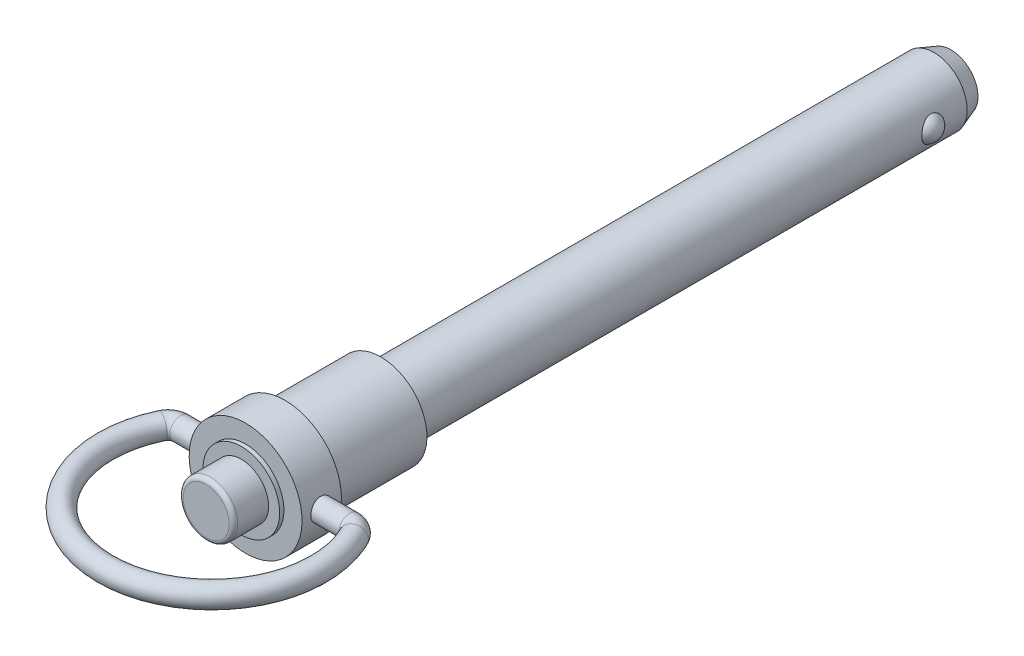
ISO-10303-21;
HEADER;
FILE_DESCRIPTION(('STEP AP214'),'2;1');
FILE_NAME('part.step','',(''),(''),'','','');
FILE_SCHEMA(('AUTOMOTIVE_DESIGN { 1 0 10303 214 1 1 1 1 }'));
ENDSEC;
DATA;
#1=APPLICATION_CONTEXT('core data for automotive mechanical design processes');
#2=APPLICATION_PROTOCOL_DEFINITION('international standard','automotive_design',2000,#1);
#3=PRODUCT_CONTEXT('',#1,'mechanical');
#4=PRODUCT('Part','Part','',(#3));
#5=PRODUCT_RELATED_PRODUCT_CATEGORY('part','',(#4));
#6=PRODUCT_DEFINITION_FORMATION('','',#4);
#7=PRODUCT_DEFINITION_CONTEXT('part definition',#1,'design');
#8=PRODUCT_DEFINITION('design','',#6,#7);
#9=PRODUCT_DEFINITION_SHAPE('','',#8);
#10=(LENGTH_UNIT() NAMED_UNIT(*) SI_UNIT(.MILLI.,.METRE.));
#11=(NAMED_UNIT(*) PLANE_ANGLE_UNIT() SI_UNIT($,.RADIAN.));
#12=(NAMED_UNIT(*) SI_UNIT($,.STERADIAN.) SOLID_ANGLE_UNIT());
#13=UNCERTAINTY_MEASURE_WITH_UNIT(LENGTH_MEASURE(1.E-05),#10,'distance_accuracy_value','');
#14=(GEOMETRIC_REPRESENTATION_CONTEXT(3) GLOBAL_UNCERTAINTY_ASSIGNED_CONTEXT((#13)) GLOBAL_UNIT_ASSIGNED_CONTEXT((#10,
#11,#12)) REPRESENTATION_CONTEXT('',''));
#15=CARTESIAN_POINT('',(0.,0.,0.));
#16=DIRECTION('',(0.,0.,1.));
#17=DIRECTION('',(1.,0.,0.));
#18=AXIS2_PLACEMENT_3D('',#15,#16,#17);
#19=CARTESIAN_POINT('',(0.,0.,20.828));
#20=DIRECTION('',(0.,0.,1.));
#21=DIRECTION('',(0.,-1.,0.));
#22=AXIS2_PLACEMENT_3D('',#19,#20,#21);
#23=PLANE('',#22);
#24=CARTESIAN_POINT('',(0.,0.,20.828));
#25=DIRECTION('',(0.,0.,-1.));
#26=DIRECTION('',(0.,1.,0.));
#27=AXIS2_PLACEMENT_3D('',#24,#25,#26);
#28=CIRCLE('',#27,2.7432);
#29=CARTESIAN_POINT('',(0.,2.7432,20.828));
#30=VERTEX_POINT('',#29);
#31=CARTESIAN_POINT('',(0.,-2.7432,20.828));
#32=VERTEX_POINT('',#31);
#33=EDGE_CURVE('E33',#30,#32,#28,.T.);
#34=ORIENTED_EDGE('',*,*,#33,.F.);
#35=CARTESIAN_POINT('',(0.,0.,20.828));
#36=DIRECTION('',(0.,0.,-1.));
#37=DIRECTION('',(0.,-1.,0.));
#38=AXIS2_PLACEMENT_3D('',#35,#36,#37);
#39=CIRCLE('',#38,2.7432);
#40=EDGE_CURVE('E28',#32,#30,#39,.T.);
#41=ORIENTED_EDGE('',*,*,#40,.F.);
#42=EDGE_LOOP('',(#34,#41));
#43=FACE_BOUND('',#42,.T.);
#44=ADVANCED_FACE('F14',(#43),#23,.T.);
#45=CARTESIAN_POINT('',(0.,0.,20.32));
#46=DIRECTION('',(0.,0.,1.));
#47=DIRECTION('',(0.,-1.,0.));
#48=AXIS2_PLACEMENT_3D('',#45,#46,#47);
#49=TOROIDAL_SURFACE('',#48,2.7432,0.508);
#50=ORIENTED_EDGE('',*,*,#40,.T.);
#51=ORIENTED_EDGE('',*,*,#33,.T.);
#52=EDGE_LOOP('',(#50,#51));
#53=FACE_BOUND('',#52,.T.);
#54=CARTESIAN_POINT('',(0.,0.,20.32));
#55=DIRECTION('',(0.,0.,-1.));
#56=DIRECTION('',(0.,1.,0.));
#57=AXIS2_PLACEMENT_3D('',#54,#55,#56);
#58=CIRCLE('',#57,3.2512);
#59=CARTESIAN_POINT('',(0.,3.2512,20.32));
#60=VERTEX_POINT('',#59);
#61=EDGE_CURVE('E50',#60,#60,#58,.T.);
#62=ORIENTED_EDGE('',*,*,#61,.F.);
#63=EDGE_LOOP('',(#62));
#64=FACE_BOUND('',#63,.T.);
#65=ADVANCED_FACE('F39',(#53,#64),#49,.T.);
#66=CARTESIAN_POINT('',(0.,0.,20.828));
#67=DIRECTION('',(0.,0.,-1.));
#68=DIRECTION('',(0.,1.,0.));
#69=AXIS2_PLACEMENT_3D('',#66,#67,#68);
#70=CYLINDRICAL_SURFACE('',#69,3.2512);
#71=CARTESIAN_POINT('',(0.,0.,16.637));
#72=DIRECTION('',(0.,0.,-1.));
#73=DIRECTION('',(0.,1.,0.));
#74=AXIS2_PLACEMENT_3D('',#71,#72,#73);
#75=CIRCLE('',#74,3.2512);
#76=CARTESIAN_POINT('',(0.,3.2512,16.637));
#77=VERTEX_POINT('',#76);
#78=EDGE_CURVE('E59',#77,#77,#75,.T.);
#79=ORIENTED_EDGE('',*,*,#78,.F.);
#80=EDGE_LOOP('',(#79));
#81=FACE_BOUND('',#80,.T.);
#82=ORIENTED_EDGE('',*,*,#61,.T.);
#83=EDGE_LOOP('',(#82));
#84=FACE_BOUND('',#83,.T.);
#85=ADVANCED_FACE('F79',(#81,#84),#70,.T.);
#86=CARTESIAN_POINT('',(4.572,0.,16.637));
#87=DIRECTION('',(0.,0.,1.));
#88=DIRECTION('',(0.,-1.,0.));
#89=AXIS2_PLACEMENT_3D('',#86,#87,#88);
#90=PLANE('',#89);
#91=ORIENTED_EDGE('',*,*,#78,.T.);
#92=EDGE_LOOP('',(#91));
#93=FACE_BOUND('',#92,.T.);
#94=CARTESIAN_POINT('',(0.,0.,16.637));
#95=DIRECTION('',(0.,0.,-1.));
#96=DIRECTION('',(0.,1.,0.));
#97=AXIS2_PLACEMENT_3D('',#94,#95,#96);
#98=CIRCLE('',#97,4.572);
#99=CARTESIAN_POINT('',(0.,4.572,16.637));
#100=VERTEX_POINT('',#99);
#101=EDGE_CURVE('E63',#100,#100,#98,.T.);
#102=ORIENTED_EDGE('',*,*,#101,.F.);
#103=EDGE_LOOP('',(#102));
#104=FACE_BOUND('',#103,.T.);
#105=ADVANCED_FACE('F82',(#93,#104),#90,.T.);
#106=CARTESIAN_POINT('',(0.,0.,0.));
#107=DIRECTION('',(0.,0.,-1.));
#108=DIRECTION('',(0.,1.,0.));
#109=AXIS2_PLACEMENT_3D('',#106,#107,#108);
#110=CYLINDRICAL_SURFACE('',#109,4.572);
#111=ORIENTED_EDGE('',*,*,#101,.T.);
#112=EDGE_LOOP('',(#111));
#113=FACE_BOUND('',#112,.T.);
#114=CARTESIAN_POINT('',(0.,0.,16.129));
#115=DIRECTION('',(0.,0.,-1.));
#116=DIRECTION('',(0.,1.,0.));
#117=AXIS2_PLACEMENT_3D('',#114,#115,#116);
#118=CIRCLE('',#117,4.572);
#119=CARTESIAN_POINT('',(0.,4.572,16.129));
#120=VERTEX_POINT('',#119);
#121=EDGE_CURVE('E217',#120,#120,#118,.T.);
#122=ORIENTED_EDGE('',*,*,#121,.F.);
#123=EDGE_LOOP('',(#122));
#124=FACE_BOUND('',#123,.T.);
#125=ADVANCED_FACE('F181',(#113,#124),#110,.T.);
#126=CARTESIAN_POINT('',(6.731,0.,16.129));
#127=DIRECTION('',(0.,0.,1.));
#128=DIRECTION('',(0.,-1.,0.));
#129=AXIS2_PLACEMENT_3D('',#126,#127,#128);
#130=PLANE('',#129);
#131=CARTESIAN_POINT('',(0.,0.,16.129));
#132=DIRECTION('',(0.,0.,-1.));
#133=DIRECTION('',(0.,1.,0.));
#134=AXIS2_PLACEMENT_3D('',#131,#132,#133);
#135=CIRCLE('',#134,6.731);
#136=CARTESIAN_POINT('',(0.,6.731,16.129));
#137=VERTEX_POINT('',#136);
#138=EDGE_CURVE('E220',#137,#137,#135,.T.);
#139=ORIENTED_EDGE('',*,*,#138,.F.);
#140=EDGE_LOOP('',(#139));
#141=FACE_BOUND('',#140,.T.);
#142=ORIENTED_EDGE('',*,*,#121,.T.);
#143=EDGE_LOOP('',(#142));
#144=FACE_BOUND('',#143,.T.);
#145=ADVANCED_FACE('F170',(#141,#144),#130,.T.);
#146=CARTESIAN_POINT('',(0.,0.,0.));
#147=DIRECTION('',(0.,0.,-1.));
#148=DIRECTION('',(0.,1.,0.));
#149=AXIS2_PLACEMENT_3D('',#146,#147,#148);
#150=CYLINDRICAL_SURFACE('',#149,6.731);
#151=CARTESIAN_POINT('',(0.,0.,11.43));
#152=DIRECTION('',(0.,0.,-1.));
#153=DIRECTION('',(0.,1.,0.));
#154=AXIS2_PLACEMENT_3D('',#151,#152,#153);
#155=CIRCLE('',#154,6.731);
#156=CARTESIAN_POINT('',(0.,6.731,11.43));
#157=VERTEX_POINT('',#156);
#158=EDGE_CURVE('E222',#157,#157,#155,.T.);
#159=ORIENTED_EDGE('',*,*,#158,.F.);
#160=EDGE_LOOP('',(#159));
#161=FACE_BOUND('',#160,.T.);
#162=ORIENTED_EDGE('',*,*,#138,.T.);
#163=EDGE_LOOP('',(#162));
#164=FACE_BOUND('',#163,.T.);
#165=CARTESIAN_POINT('',(-6.6051722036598,1.2954,13.7922));
#166=CARTESIAN_POINT('',(-6.60517361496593,1.2953972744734,13.864236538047));
#167=CARTESIAN_POINT('',(-6.60636346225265,1.28937073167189,13.9363080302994));
#168=CARTESIAN_POINT('',(-6.61098794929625,1.26544153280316,14.0784162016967));
#169=CARTESIAN_POINT('',(-6.61442445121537,1.24752902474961,14.1484511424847));
#170=CARTESIAN_POINT('',(-6.62313895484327,1.20040052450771,14.2844095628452));
#171=CARTESIAN_POINT('',(-6.62841519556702,1.17119533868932,14.3503369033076));
#172=CARTESIAN_POINT('',(-6.64021258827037,1.10233951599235,14.4763528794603));
#173=CARTESIAN_POINT('',(-6.64673365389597,1.06268960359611,14.5364419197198));
#174=CARTESIAN_POINT('',(-6.66038139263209,0.973516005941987,14.6498669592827));
#175=CARTESIAN_POINT('',(-6.66751428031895,0.9238817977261,14.7031153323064));
#176=CARTESIAN_POINT('',(-6.68152715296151,0.816387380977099,14.8005834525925));
#177=CARTESIAN_POINT('',(-6.6884071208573,0.758526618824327,14.8448025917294));
#178=CARTESIAN_POINT('',(-6.7012057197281,0.635644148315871,14.9232944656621));
#179=CARTESIAN_POINT('',(-6.70711617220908,0.570568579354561,14.9574843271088));
#180=CARTESIAN_POINT('',(-6.71724013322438,0.435464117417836,15.014412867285));
#181=CARTESIAN_POINT('',(-6.72145378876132,0.365435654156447,15.0371525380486));
#182=CARTESIAN_POINT('',(-6.72766549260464,0.223321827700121,15.0702635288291));
#183=CARTESIAN_POINT('',(-6.72968999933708,0.151272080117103,15.0807826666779));
#184=CARTESIAN_POINT('',(-6.73138656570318,0.00640388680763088,15.089614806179));
#185=CARTESIAN_POINT('',(-6.73105883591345,-0.0664144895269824,15.0879289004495));
#186=CARTESIAN_POINT('',(-6.72810846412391,-0.209738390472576,15.072511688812));
#187=CARTESIAN_POINT('',(-6.72551615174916,-0.280261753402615,15.0589395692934));
#188=CARTESIAN_POINT('',(-6.71836197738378,-0.418011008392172,15.0203872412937));
#189=CARTESIAN_POINT('',(-6.71380004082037,-0.485236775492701,14.9954066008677));
#190=CARTESIAN_POINT('',(-6.70316878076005,-0.614941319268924,14.9345963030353));
#191=CARTESIAN_POINT('',(-6.69709072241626,-0.67738974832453,14.8987035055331));
#192=CARTESIAN_POINT('',(-6.68409856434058,-0.795436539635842,14.8171343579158));
#193=CARTESIAN_POINT('',(-6.677184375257,-0.851034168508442,14.7714569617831));
#194=CARTESIAN_POINT('',(-6.66315320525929,-0.954744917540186,14.6707395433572));
#195=CARTESIAN_POINT('',(-6.65603475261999,-1.00272266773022,14.6155602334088));
#196=CARTESIAN_POINT('',(-6.64250376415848,-1.08876420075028,14.4978679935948));
#197=CARTESIAN_POINT('',(-6.63609123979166,-1.12682782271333,14.4353549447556));
#198=CARTESIAN_POINT('',(-6.62469571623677,-1.19200234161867,14.3045844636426));
#199=CARTESIAN_POINT('',(-6.61971540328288,-1.21909269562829,14.2363165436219));
#200=CARTESIAN_POINT('',(-6.61178862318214,-1.26138008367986,14.0960804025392));
#201=CARTESIAN_POINT('',(-6.60884191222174,-1.27657854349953,14.0241126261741));
#202=CARTESIAN_POINT('',(-6.60536444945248,-1.29445125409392,13.8797427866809));
#203=CARTESIAN_POINT('',(-6.60479610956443,-1.29732037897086,13.8073657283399));
#204=CARTESIAN_POINT('',(-6.60603903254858,-1.29097613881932,13.6631669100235));
#205=CARTESIAN_POINT('',(-6.60785017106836,-1.28176340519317,13.5913451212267));
#206=CARTESIAN_POINT('',(-6.6136128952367,-1.25168453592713,13.4509418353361));
#207=CARTESIAN_POINT('',(-6.61754556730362,-1.23092132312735,13.3823374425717));
#208=CARTESIAN_POINT('',(-6.62709183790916,-1.17844042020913,13.249581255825));
#209=CARTESIAN_POINT('',(-6.63270556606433,-1.14672188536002,13.1854298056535));
#210=CARTESIAN_POINT('',(-6.6450665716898,-1.07278507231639,13.0625442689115));
#211=CARTESIAN_POINT('',(-6.65182676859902,-1.03044414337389,13.0038853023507));
#212=CARTESIAN_POINT('',(-6.66568301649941,-0.936629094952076,12.8944341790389));
#213=CARTESIAN_POINT('',(-6.67277909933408,-0.885154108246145,12.8436427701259));
#214=CARTESIAN_POINT('',(-6.68662882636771,-0.773660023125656,12.7506362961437));
#215=CARTESIAN_POINT('',(-6.69337621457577,-0.713530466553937,12.7085525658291));
#216=CARTESIAN_POINT('',(-6.70566168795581,-0.586941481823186,12.6350847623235));
#217=CARTESIAN_POINT('',(-6.71119982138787,-0.520482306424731,12.6037002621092));
#218=CARTESIAN_POINT('',(-6.72041595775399,-0.383476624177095,12.5527164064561));
#219=CARTESIAN_POINT('',(-6.72410395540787,-0.312954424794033,12.5330536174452));
#220=CARTESIAN_POINT('',(-6.72924701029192,-0.169530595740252,12.5058694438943));
#221=CARTESIAN_POINT('',(-6.7307023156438,-0.0966292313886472,12.4983467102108));
#222=CARTESIAN_POINT('',(-6.73121071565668,0.0482259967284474,12.4957052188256));
#223=CARTESIAN_POINT('',(-6.73030215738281,0.120176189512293,12.5003884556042));
#224=CARTESIAN_POINT('',(-6.72626496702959,0.26224403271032,12.5215909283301));
#225=CARTESIAN_POINT('',(-6.72313635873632,0.332361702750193,12.5381100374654));
#226=CARTESIAN_POINT('',(-6.71501101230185,0.468662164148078,12.5824301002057));
#227=CARTESIAN_POINT('',(-6.710017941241,0.534852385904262,12.6102089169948));
#228=CARTESIAN_POINT('',(-6.69870305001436,0.661661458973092,12.6762356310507));
#229=CARTESIAN_POINT('',(-6.69238113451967,0.722279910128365,12.7144842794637));
#230=CARTESIAN_POINT('',(-6.6789853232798,0.837208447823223,12.8010411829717));
#231=CARTESIAN_POINT('',(-6.67190155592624,0.891410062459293,12.8494919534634));
#232=CARTESIAN_POINT('',(-6.65784127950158,0.990982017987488,12.95478313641));
#233=CARTESIAN_POINT('',(-6.65086479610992,1.03635027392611,13.0116255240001));
#234=CARTESIAN_POINT('',(-6.63773378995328,1.11738877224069,13.1327559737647));
#235=CARTESIAN_POINT('',(-6.63158802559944,1.15295925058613,13.1971117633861));
#236=CARTESIAN_POINT('',(-6.62092027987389,1.21272619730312,13.3309847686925));
#237=CARTESIAN_POINT('',(-6.61639678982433,1.23693323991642,13.4004971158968));
#238=CARTESIAN_POINT('',(-6.61041337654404,1.26845390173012,13.5238636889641));
#239=CARTESIAN_POINT('',(-6.60845980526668,1.27854107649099,13.57700269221));
#240=CARTESIAN_POINT('',(-6.60583870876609,1.29201504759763,13.6841545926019));
#241=CARTESIAN_POINT('',(-6.60517114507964,1.29540204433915,13.7381674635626));
#242=CARTESIAN_POINT('',(-6.6051722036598,1.2954,13.7922));
#243=B_SPLINE_CURVE_WITH_KNOTS('',3,(#165,#166,#167,#168,#169,#170,#171,#172,#173,#174,#175,
#176,#177,#178,#179,#180,#181,#182,#183,#184,#185,#186,#187,#188,#189,#190,#191,#192,#193,#194,
#195,#196,#197,#198,#199,#200,#201,#202,#203,#204,#205,#206,#207,#208,#209,#210,#211,#212,#213,
#214,#215,#216,#217,#218,#219,#220,#221,#222,#223,#224,#225,#226,#227,#228,#229,#230,#231,#232,
#233,#234,#235,#236,#237,#238,#239,#240,#241,#242),.UNSPECIFIED.,.T.,.F.,(4,2,2,2,2,2,2,2,2,2,2,
2,2,2,2,2,2,2,2,2,2,2,2,2,2,2,2,2,2,2,2,2,2,2,2,2,2,2,4),(0.,0.215911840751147,
0.432002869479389,0.64788762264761,0.86375740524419,1.08216318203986,1.30058366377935,
1.52076118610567,1.74091962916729,1.95838638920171,2.1758336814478,2.39041258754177,
2.60499961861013,2.82085272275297,3.0367289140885,3.25609136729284,3.47545737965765,
3.69523218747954,3.91498064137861,4.13124273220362,4.34749352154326,4.56184753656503,
4.7762180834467,4.99318797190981,5.21017847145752,5.430235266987,5.65028327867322,
5.86912939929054,6.08795119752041,6.30324544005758,6.51853737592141,6.73340808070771,
6.94829420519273,7.16640910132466,7.38457541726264,7.60488731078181,7.82499378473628,
7.9869478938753,8.14889715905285),.UNSPECIFIED.);
#244=CARTESIAN_POINT('',(-6.6051722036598,1.2954,13.7922));
#245=VERTEX_POINT('',#244);
#246=EDGE_CURVE('E191',#245,#245,#243,.T.);
#247=ORIENTED_EDGE('',*,*,#246,.T.);
#248=EDGE_LOOP('',(#247));
#249=FACE_BOUND('',#248,.T.);
#250=CARTESIAN_POINT('',(6.6051722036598,1.2954,13.7922));
#251=CARTESIAN_POINT('',(6.60517361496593,1.2953972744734,13.720163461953));
#252=CARTESIAN_POINT('',(6.60636346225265,1.2893707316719,13.6480919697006));
#253=CARTESIAN_POINT('',(6.61098794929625,1.26544153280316,13.5059837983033));
#254=CARTESIAN_POINT('',(6.61442445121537,1.24752902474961,13.4359488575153));
#255=CARTESIAN_POINT('',(6.62313895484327,1.20040052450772,13.2999904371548));
#256=CARTESIAN_POINT('',(6.62841519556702,1.17119533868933,13.2340630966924));
#257=CARTESIAN_POINT('',(6.64021258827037,1.10233951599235,13.1080471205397));
#258=CARTESIAN_POINT('',(6.64673365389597,1.06268960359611,13.0479580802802));
#259=CARTESIAN_POINT('',(6.66038139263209,0.973516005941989,12.9345330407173));
#260=CARTESIAN_POINT('',(6.66751428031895,0.923881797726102,12.8812846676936));
#261=CARTESIAN_POINT('',(6.68152715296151,0.816387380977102,12.7838165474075));
#262=CARTESIAN_POINT('',(6.6884071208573,0.758526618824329,12.7395974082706));
#263=CARTESIAN_POINT('',(6.7012057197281,0.635644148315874,12.6611055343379));
#264=CARTESIAN_POINT('',(6.70711617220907,0.570568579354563,12.6269156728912));
#265=CARTESIAN_POINT('',(6.71724013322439,0.435464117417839,12.569987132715));
#266=CARTESIAN_POINT('',(6.72145378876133,0.36543565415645,12.5472474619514));
#267=CARTESIAN_POINT('',(6.72766549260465,0.223321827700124,12.5141364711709));
#268=CARTESIAN_POINT('',(6.72968999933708,0.151272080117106,12.5036173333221));
#269=CARTESIAN_POINT('',(6.73138656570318,0.00640388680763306,12.494785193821));
#270=CARTESIAN_POINT('',(6.73105883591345,-0.0664144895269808,12.4964710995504));
#271=CARTESIAN_POINT('',(6.72810846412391,-0.209738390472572,12.511888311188));
#272=CARTESIAN_POINT('',(6.72551615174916,-0.280261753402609,12.5254604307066));
#273=CARTESIAN_POINT('',(6.71836197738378,-0.418011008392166,12.5640127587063));
#274=CARTESIAN_POINT('',(6.71380004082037,-0.4852367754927,12.5889933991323));
#275=CARTESIAN_POINT('',(6.70316878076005,-0.614941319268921,12.6498036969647));
#276=CARTESIAN_POINT('',(6.69709072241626,-0.67738974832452,12.6856964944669));
#277=CARTESIAN_POINT('',(6.68409856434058,-0.795436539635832,12.7672656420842));
#278=CARTESIAN_POINT('',(6.677184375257,-0.851034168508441,12.8129430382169));
#279=CARTESIAN_POINT('',(6.66315320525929,-0.954744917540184,12.9136604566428));
#280=CARTESIAN_POINT('',(6.65603475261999,-1.00272266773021,12.9688397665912));
#281=CARTESIAN_POINT('',(6.64250376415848,-1.08876420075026,13.0865320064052));
#282=CARTESIAN_POINT('',(6.63609123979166,-1.12682782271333,13.1490450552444));
#283=CARTESIAN_POINT('',(6.62469571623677,-1.19200234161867,13.2798155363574));
#284=CARTESIAN_POINT('',(6.61971540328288,-1.21909269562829,13.3480834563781));
#285=CARTESIAN_POINT('',(6.61178862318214,-1.26138008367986,13.4883195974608));
#286=CARTESIAN_POINT('',(6.60884191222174,-1.27657854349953,13.5602873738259));
#287=CARTESIAN_POINT('',(6.60536444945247,-1.29445125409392,13.7046572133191));
#288=CARTESIAN_POINT('',(6.60479610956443,-1.29732037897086,13.7770342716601));
#289=CARTESIAN_POINT('',(6.60603903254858,-1.29097613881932,13.9212330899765));
#290=CARTESIAN_POINT('',(6.60785017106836,-1.28176340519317,13.9930548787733));
#291=CARTESIAN_POINT('',(6.6136128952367,-1.25168453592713,14.1334581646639));
#292=CARTESIAN_POINT('',(6.61754556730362,-1.23092132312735,14.2020625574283));
#293=CARTESIAN_POINT('',(6.62709183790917,-1.17844042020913,14.334818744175));
#294=CARTESIAN_POINT('',(6.63270556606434,-1.14672188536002,14.3989701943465));
#295=CARTESIAN_POINT('',(6.64506657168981,-1.07278507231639,14.5218557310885));
#296=CARTESIAN_POINT('',(6.65182676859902,-1.03044414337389,14.5805146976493));
#297=CARTESIAN_POINT('',(6.66568301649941,-0.936629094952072,14.6899658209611));
#298=CARTESIAN_POINT('',(6.67277909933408,-0.885154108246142,14.7407572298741));
#299=CARTESIAN_POINT('',(6.68662882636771,-0.773660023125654,14.8337637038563));
#300=CARTESIAN_POINT('',(6.69337621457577,-0.713530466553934,14.8758474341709));
#301=CARTESIAN_POINT('',(6.70566168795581,-0.586941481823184,14.9493152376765));
#302=CARTESIAN_POINT('',(6.71119982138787,-0.520482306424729,14.9806997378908));
#303=CARTESIAN_POINT('',(6.72041595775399,-0.383476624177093,15.0316835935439));
#304=CARTESIAN_POINT('',(6.72410395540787,-0.31295442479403,15.0513463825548));
#305=CARTESIAN_POINT('',(6.72924701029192,-0.169530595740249,15.0785305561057));
#306=CARTESIAN_POINT('',(6.7307023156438,-0.0966292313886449,15.0860532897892));
#307=CARTESIAN_POINT('',(6.73121071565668,0.0482259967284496,15.0886947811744));
#308=CARTESIAN_POINT('',(6.73030215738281,0.120176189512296,15.0840115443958));
#309=CARTESIAN_POINT('',(6.72626496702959,0.262244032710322,15.0628090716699));
#310=CARTESIAN_POINT('',(6.72313635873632,0.332361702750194,15.0462899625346));
#311=CARTESIAN_POINT('',(6.71501101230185,0.46866216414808,15.0019698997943));
#312=CARTESIAN_POINT('',(6.710017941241,0.534852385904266,14.9741910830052));
#313=CARTESIAN_POINT('',(6.69870305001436,0.661661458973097,14.9081643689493));
#314=CARTESIAN_POINT('',(6.69238113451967,0.722279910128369,14.8699157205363));
#315=CARTESIAN_POINT('',(6.6789853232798,0.837208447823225,14.7833588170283));
#316=CARTESIAN_POINT('',(6.67190155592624,0.891410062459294,14.7349080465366));
#317=CARTESIAN_POINT('',(6.65784127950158,0.990982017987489,14.62961686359));
#318=CARTESIAN_POINT('',(6.65086479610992,1.03635027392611,14.5727744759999));
#319=CARTESIAN_POINT('',(6.63773378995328,1.1173887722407,14.4516440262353));
#320=CARTESIAN_POINT('',(6.63158802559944,1.15295925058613,14.3872882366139));
#321=CARTESIAN_POINT('',(6.62092027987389,1.21272619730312,14.2534152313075));
#322=CARTESIAN_POINT('',(6.61639678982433,1.23693323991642,14.1839028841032));
#323=CARTESIAN_POINT('',(6.61041337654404,1.26845390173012,14.0605363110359));
#324=CARTESIAN_POINT('',(6.60845980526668,1.27854107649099,14.00739730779));
#325=CARTESIAN_POINT('',(6.60583870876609,1.29201504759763,13.9002454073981));
#326=CARTESIAN_POINT('',(6.60517114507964,1.29540204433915,13.8462325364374));
#327=CARTESIAN_POINT('',(6.6051722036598,1.2954,13.7922));
#328=B_SPLINE_CURVE_WITH_KNOTS('',3,(#250,#251,#252,#253,#254,#255,#256,#257,#258,#259,#260,
#261,#262,#263,#264,#265,#266,#267,#268,#269,#270,#271,#272,#273,#274,#275,#276,#277,#278,#279,
#280,#281,#282,#283,#284,#285,#286,#287,#288,#289,#290,#291,#292,#293,#294,#295,#296,#297,#298,
#299,#300,#301,#302,#303,#304,#305,#306,#307,#308,#309,#310,#311,#312,#313,#314,#315,#316,#317,
#318,#319,#320,#321,#322,#323,#324,#325,#326,#327),.UNSPECIFIED.,.T.,.F.,(4,2,2,2,2,2,2,2,2,2,2,
2,2,2,2,2,2,2,2,2,2,2,2,2,2,2,2,2,2,2,2,2,2,2,2,2,2,2,4),(0.,0.215911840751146,
0.432002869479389,0.64788762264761,0.86375740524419,1.08216318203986,1.30058366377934,
1.52076118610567,1.74091962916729,1.95838638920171,2.1758336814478,2.39041258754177,
2.60499961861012,2.82085272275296,3.0367289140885,3.25609136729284,3.47545737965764,
3.69523218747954,3.91498064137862,4.13124273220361,4.34749352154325,4.56184753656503,
4.77621808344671,4.99318797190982,5.21017847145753,5.43023526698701,5.65028327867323,
5.86912939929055,6.08795119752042,6.30324544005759,6.51853737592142,6.73340808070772,
6.94829420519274,7.16640910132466,7.38457541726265,7.60488731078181,7.82499378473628,
7.98694789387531,8.14889715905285),.UNSPECIFIED.);
#329=CARTESIAN_POINT('',(6.6051722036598,1.2954,13.7922));
#330=VERTEX_POINT('',#329);
#331=EDGE_CURVE('E198',#330,#330,#328,.T.);
#332=ORIENTED_EDGE('',*,*,#331,.T.);
#333=EDGE_LOOP('',(#332));
#334=FACE_BOUND('',#333,.T.);
#335=ADVANCED_FACE('F164',(#161,#164,#249,#334),#150,.T.);
#336=CARTESIAN_POINT('',(5.7785,0.,11.43));
#337=DIRECTION('',(0.,0.,-1.));
#338=DIRECTION('',(0.,1.,0.));
#339=AXIS2_PLACEMENT_3D('',#336,#337,#338);
#340=PLANE('',#339);
#341=CARTESIAN_POINT('',(0.,0.,11.43));
#342=DIRECTION('',(0.,0.,-1.));
#343=DIRECTION('',(0.,1.,0.));
#344=AXIS2_PLACEMENT_3D('',#341,#342,#343);
#345=CIRCLE('',#344,5.9);
#346=CARTESIAN_POINT('',(0.,5.9,11.43));
#347=VERTEX_POINT('',#346);
#348=EDGE_CURVE('E22',#347,#347,#345,.F.);
#349=ORIENTED_EDGE('',*,*,#348,.T.);
#350=EDGE_LOOP('',(#349));
#351=FACE_BOUND('',#350,.T.);
#352=ORIENTED_EDGE('',*,*,#158,.T.);
#353=EDGE_LOOP('',(#352));
#354=FACE_BOUND('',#353,.T.);
#355=ADVANCED_FACE('F87',(#351,#354),#340,.T.);
#356=CARTESIAN_POINT('',(10.0803124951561,0.,15.3162));
#357=DIRECTION('',(0.,1.,0.));
#358=DIRECTION('',(-1.,0.,0.));
#359=AXIS2_PLACEMENT_3D('',#356,#357,#358);
#360=TOROIDAL_SURFACE('',#359,1.524,1.2954);
#361=CARTESIAN_POINT('',(11.4549005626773,0.,14.658109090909));
#362=DIRECTION('',(-0.431818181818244,0.,-0.901960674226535));
#363=DIRECTION('',(0.901960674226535,0.,-0.431818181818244));
#364=AXIS2_PLACEMENT_3D('',#361,#362,#363);
#365=CIRCLE('',#364,1.2954);
#366=CARTESIAN_POINT('',(12.6233004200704,0.,14.0987318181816));
#367=VERTEX_POINT('',#366);
#368=EDGE_CURVE('E41',#367,#367,#365,.T.);
#369=ORIENTED_EDGE('',*,*,#368,.T.);
#370=EDGE_LOOP('',(#369));
#371=FACE_BOUND('',#370,.T.);
#372=CARTESIAN_POINT('',(10.0803124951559,0.,13.7922));
#373=DIRECTION('',(1.,0.,0.));
#374=DIRECTION('',(0.,1.,0.));
#375=AXIS2_PLACEMENT_3D('',#372,#373,#374);
#376=CIRCLE('',#375,1.2954);
#377=CARTESIAN_POINT('',(10.0803124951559,1.2954,13.7922));
#378=VERTEX_POINT('',#377);
#379=EDGE_CURVE('E56',#378,#378,#376,.F.);
#380=ORIENTED_EDGE('',*,*,#379,.F.);
#381=EDGE_LOOP('',(#380));
#382=FACE_BOUND('',#381,.T.);
#383=ADVANCED_FACE('F84',(#371,#382),#360,.T.);
#384=CARTESIAN_POINT('',(-10.0803124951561,0.,13.7922));
#385=DIRECTION('',(1.,0.,0.));
#386=DIRECTION('',(0.,1.,0.));
#387=AXIS2_PLACEMENT_3D('',#384,#385,#386);
#388=CYLINDRICAL_SURFACE('',#387,1.2954);
#389=ORIENTED_EDGE('',*,*,#331,.F.);
#390=EDGE_LOOP('',(#389));
#391=FACE_BOUND('',#390,.T.);
#392=ORIENTED_EDGE('',*,*,#379,.T.);
#393=EDGE_LOOP('',(#392));
#394=FACE_BOUND('',#393,.T.);
#395=ADVANCED_FACE('F76',(#391,#394),#388,.T.);
#396=CARTESIAN_POINT('',(0.,0.,20.1422));
#397=DIRECTION('',(0.,1.,0.));
#398=DIRECTION('',(-1.,0.,0.));
#399=AXIS2_PLACEMENT_3D('',#396,#397,#398);
#400=TOROIDAL_SURFACE('',#399,12.7,1.2954);
#401=CARTESIAN_POINT('',(-11.4549005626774,0.,14.6581090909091));
#402=DIRECTION('',(-0.43181818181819,0.,0.901960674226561));
#403=DIRECTION('',(-0.901960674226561,0.,-0.43181818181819));
#404=AXIS2_PLACEMENT_3D('',#401,#402,#403);
#405=CIRCLE('',#404,1.2954);
#406=CARTESIAN_POINT('',(-12.6233004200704,0.,14.0987318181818));
#407=VERTEX_POINT('',#406);
#408=EDGE_CURVE('E53',#407,#407,#405,.F.);
#409=ORIENTED_EDGE('',*,*,#408,.F.);
#410=EDGE_LOOP('',(#409));
#411=FACE_BOUND('',#410,.T.);
#412=ORIENTED_EDGE('',*,*,#368,.F.);
#413=EDGE_LOOP('',(#412));
#414=FACE_BOUND('',#413,.T.);
#415=ADVANCED_FACE('F74',(#411,#414),#400,.T.);
#416=CARTESIAN_POINT('',(-10.0803124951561,0.,15.3162));
#417=DIRECTION('',(0.,1.,0.));
#418=DIRECTION('',(-1.,0.,0.));
#419=AXIS2_PLACEMENT_3D('',#416,#417,#418);
#420=TOROIDAL_SURFACE('',#419,1.524,1.2954);
#421=CARTESIAN_POINT('',(-10.0803124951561,0.,13.7922));
#422=DIRECTION('',(1.,0.,0.));
#423=DIRECTION('',(0.,1.,0.));
#424=AXIS2_PLACEMENT_3D('',#421,#422,#423);
#425=CIRCLE('',#424,1.2954);
#426=CARTESIAN_POINT('',(-10.0803124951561,1.2954,13.7922));
#427=VERTEX_POINT('',#426);
#428=EDGE_CURVE('E60',#427,#427,#425,.T.);
#429=ORIENTED_EDGE('',*,*,#428,.F.);
#430=EDGE_LOOP('',(#429));
#431=FACE_BOUND('',#430,.T.);
#432=ORIENTED_EDGE('',*,*,#408,.T.);
#433=EDGE_LOOP('',(#432));
#434=FACE_BOUND('',#433,.T.);
#435=ADVANCED_FACE('F69',(#431,#434),#420,.T.);
#436=CARTESIAN_POINT('',(-10.0803124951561,0.,13.7922));
#437=DIRECTION('',(1.,0.,0.));
#438=DIRECTION('',(0.,1.,0.));
#439=AXIS2_PLACEMENT_3D('',#436,#437,#438);
#440=CYLINDRICAL_SURFACE('',#439,1.2954);
#441=ORIENTED_EDGE('',*,*,#246,.F.);
#442=EDGE_LOOP('',(#441));
#443=FACE_BOUND('',#442,.T.);
#444=ORIENTED_EDGE('',*,*,#428,.T.);
#445=EDGE_LOOP('',(#444));
#446=FACE_BOUND('',#445,.T.);
#447=ADVANCED_FACE('F73',(#443,#446),#440,.T.);
#448=CARTESIAN_POINT('',(0.,0.,35.1949170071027));
#449=DIRECTION('',(0.,0.,-1.));
#450=DIRECTION('',(0.,1.,0.));
#451=AXIS2_PLACEMENT_3D('',#448,#449,#450);
#452=CYLINDRICAL_SURFACE('',#451,5.5);
#453=CARTESIAN_POINT('',(0.,0.,11.03));
#454=DIRECTION('',(0.,0.,-1.));
#455=DIRECTION('',(0.,1.,0.));
#456=AXIS2_PLACEMENT_3D('',#453,#454,#455);
#457=CIRCLE('',#456,5.5);
#458=CARTESIAN_POINT('',(0.,5.5,11.03));
#459=VERTEX_POINT('',#458);
#460=EDGE_CURVE('E9',#459,#459,#457,.T.);
#461=ORIENTED_EDGE('',*,*,#460,.T.);
#462=EDGE_LOOP('',(#461));
#463=FACE_BOUND('',#462,.T.);
#464=CARTESIAN_POINT('',(0.,0.,0.));
#465=DIRECTION('',(0.,0.,-1.));
#466=DIRECTION('',(0.,1.,0.));
#467=AXIS2_PLACEMENT_3D('',#464,#465,#466);
#468=CIRCLE('',#467,5.5);
#469=CARTESIAN_POINT('',(0.,5.5,0.));
#470=VERTEX_POINT('',#469);
#471=EDGE_CURVE('E199',#470,#470,#468,.T.);
#472=ORIENTED_EDGE('',*,*,#471,.F.);
#473=EDGE_LOOP('',(#472));
#474=FACE_BOUND('',#473,.T.);
#475=ADVANCED_FACE('F188',(#463,#474),#452,.T.);
#476=CARTESIAN_POINT('',(3.22979748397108,0.,-67.9908));
#477=DIRECTION('',(0.,0.,1.));
#478=DIRECTION('',(0.,-1.,0.));
#479=AXIS2_PLACEMENT_3D('',#476,#477,#478);
#480=PLANE('',#479);
#481=CARTESIAN_POINT('',(0.,0.,-67.9907999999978));
#482=DIRECTION('',(0.,0.,1.));
#483=DIRECTION('',(0.,-1.,0.));
#484=AXIS2_PLACEMENT_3D('',#481,#482,#483);
#485=CIRCLE('',#484,3.22979748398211);
#486=CARTESIAN_POINT('',(0.,-3.22979748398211,-67.9907999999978));
#487=VERTEX_POINT('',#486);
#488=EDGE_CURVE('E119',#487,#487,#485,.T.);
#489=ORIENTED_EDGE('',*,*,#488,.F.);
#490=EDGE_LOOP('',(#489));
#491=FACE_BOUND('',#490,.T.);
#492=ADVANCED_FACE('F130',(#491),#480,.F.);
#493=CARTESIAN_POINT('',(3.12293,0.,-61.8948));
#494=DIRECTION('',(0.,0.,1.));
#495=DIRECTION('',(1.,0.,0.));
#496=AXIS2_PLACEMENT_3D('',#493,#494,#495);
#497=SPHERICAL_SURFACE('',#496,1.5875);
#498=CARTESIAN_POINT('',(3.969385,0.,-60.5517921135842));
#499=CARTESIAN_POINT('',(3.96938133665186,0.0871787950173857,-60.5517940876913));
#500=CARTESIAN_POINT('',(3.96648576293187,0.17442809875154,-60.5584820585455));
#501=CARTESIAN_POINT('',(3.95516905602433,0.346584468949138,-60.5851998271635));
#502=CARTESIAN_POINT('',(3.94674017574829,0.431488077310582,-60.60524833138));
#503=CARTESIAN_POINT('',(3.92519423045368,0.596479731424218,-60.6585272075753));
#504=CARTESIAN_POINT('',(3.91207555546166,0.676566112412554,-60.6917621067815));
#505=CARTESIAN_POINT('',(3.88253654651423,0.829452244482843,-60.7710588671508));
#506=CARTESIAN_POINT('',(3.86611699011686,0.90225370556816,-60.8171177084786));
#507=CARTESIAN_POINT('',(3.83222363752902,1.03672093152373,-60.9203356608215));
#508=CARTESIAN_POINT('',(3.81477966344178,1.0985904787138,-60.9772380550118));
#509=CARTESIAN_POINT('',(3.78068495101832,1.21073548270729,-61.1017462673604));
#510=CARTESIAN_POINT('',(3.76403384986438,1.26101628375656,-61.1693471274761));
#511=CARTESIAN_POINT('',(3.73507217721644,1.34426479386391,-61.3077911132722));
#512=CARTESIAN_POINT('',(3.72252093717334,1.37829571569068,-61.3779422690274));
#513=CARTESIAN_POINT('',(3.70178973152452,1.43305274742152,-61.5238520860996));
#514=CARTESIAN_POINT('',(3.69360549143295,1.45379187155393,-61.5996051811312));
#515=CARTESIAN_POINT('',(3.68341966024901,1.47939277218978,-61.7454817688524));
#516=CARTESIAN_POINT('',(3.680835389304,1.4857542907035,-61.8153038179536));
#517=CARTESIAN_POINT('',(3.68040725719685,1.48681628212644,-61.9550414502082));
#518=CARTESIAN_POINT('',(3.68256179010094,1.48152070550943,-62.0249569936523));
#519=CARTESIAN_POINT('',(3.69108766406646,1.4601393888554,-62.1588086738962));
#520=CARTESIAN_POINT('',(3.69721728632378,1.4446714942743,-62.2228608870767));
#521=CARTESIAN_POINT('',(3.71278611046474,1.40417367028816,-62.3474287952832));
#522=CARTESIAN_POINT('',(3.72222570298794,1.37914261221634,-62.4079440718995));
#523=CARTESIAN_POINT('',(3.74389633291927,1.3192072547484,-62.5264268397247));
#524=CARTESIAN_POINT('',(3.75622345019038,1.28394990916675,-62.5841973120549));
#525=CARTESIAN_POINT('',(3.78224213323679,1.20514746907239,-62.6934181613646));
#526=CARTESIAN_POINT('',(3.79593412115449,1.1615998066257,-62.7448665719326));
#527=CARTESIAN_POINT('',(3.82484228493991,1.06277839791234,-62.8454045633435));
#528=CARTESIAN_POINT('',(3.84007638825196,1.00677387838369,-62.8937694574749));
#529=CARTESIAN_POINT('',(3.86933265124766,0.887713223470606,-62.9813922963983));
#530=CARTESIAN_POINT('',(3.88335410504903,0.824653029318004,-63.0206449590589));
#531=CARTESIAN_POINT('',(3.90318345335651,0.722863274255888,-63.0740110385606));
#532=CARTESIAN_POINT('',(3.90984058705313,0.686009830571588,-63.0914710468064));
#533=CARTESIAN_POINT('',(3.92226926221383,0.610957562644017,-63.123476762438));
#534=CARTESIAN_POINT('',(3.92804156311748,0.572759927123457,-63.1380249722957));
#535=CARTESIAN_POINT('',(3.94381689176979,0.456514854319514,-63.1772484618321));
#536=CARTESIAN_POINT('',(3.95229851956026,0.376714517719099,-63.1975549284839));
#537=CARTESIAN_POINT('',(3.96199329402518,0.247044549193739,-63.2205332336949));
#538=CARTESIAN_POINT('',(3.96475587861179,0.197910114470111,-63.2270073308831));
#539=CARTESIAN_POINT('',(3.96845279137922,0.0991914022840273,-63.2356452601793));
#540=CARTESIAN_POINT('',(3.96938708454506,0.0496071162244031,-63.2378090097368));
#541=CARTESIAN_POINT('',(3.96938133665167,-0.0871787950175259,-63.2378059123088));
#542=CARTESIAN_POINT('',(3.96648576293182,-0.174428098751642,-63.2311179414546));
#543=CARTESIAN_POINT('',(3.95516905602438,-0.346584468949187,-63.2044001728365));
#544=CARTESIAN_POINT('',(3.94674017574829,-0.431488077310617,-63.1843516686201));
#545=CARTESIAN_POINT('',(3.92519423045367,-0.596479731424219,-63.1310727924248));
#546=CARTESIAN_POINT('',(3.91207555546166,-0.676566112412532,-63.0978378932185));
#547=CARTESIAN_POINT('',(3.88253654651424,-0.829452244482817,-63.0185411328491));
#548=CARTESIAN_POINT('',(3.86611699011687,-0.902253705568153,-62.9724822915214));
#549=CARTESIAN_POINT('',(3.83222363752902,-1.03672093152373,-62.8692643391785));
#550=CARTESIAN_POINT('',(3.81477966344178,-1.0985904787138,-62.8123619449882));
#551=CARTESIAN_POINT('',(3.78068495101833,-1.21073548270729,-62.6878537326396));
#552=CARTESIAN_POINT('',(3.76403384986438,-1.26101628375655,-62.6202528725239));
#553=CARTESIAN_POINT('',(3.73507217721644,-1.34426479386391,-62.4818088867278));
#554=CARTESIAN_POINT('',(3.72252093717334,-1.37829571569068,-62.4116577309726));
#555=CARTESIAN_POINT('',(3.70178973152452,-1.43305274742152,-62.2657479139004));
#556=CARTESIAN_POINT('',(3.69360549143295,-1.45379187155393,-62.1899948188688));
#557=CARTESIAN_POINT('',(3.68341966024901,-1.47939277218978,-62.0441182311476));
#558=CARTESIAN_POINT('',(3.680835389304,-1.4857542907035,-61.9742961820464));
#559=CARTESIAN_POINT('',(3.68040725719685,-1.48681628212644,-61.8345585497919));
#560=CARTESIAN_POINT('',(3.68256179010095,-1.48152070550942,-61.7646430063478));
#561=CARTESIAN_POINT('',(3.69108766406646,-1.4601393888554,-61.6307913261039));
#562=CARTESIAN_POINT('',(3.69721728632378,-1.44467149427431,-61.5667391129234));
#563=CARTESIAN_POINT('',(3.71278611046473,-1.40417367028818,-61.4421712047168));
#564=CARTESIAN_POINT('',(3.72222570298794,-1.37914261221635,-61.3816559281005));
#565=CARTESIAN_POINT('',(3.74389633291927,-1.31920725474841,-61.2631731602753));
#566=CARTESIAN_POINT('',(3.75622345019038,-1.28394990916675,-61.2054026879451));
#567=CARTESIAN_POINT('',(3.78224213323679,-1.20514746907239,-61.0961818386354));
#568=CARTESIAN_POINT('',(3.79593412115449,-1.1615998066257,-61.0447334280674));
#569=CARTESIAN_POINT('',(3.82484228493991,-1.06277839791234,-60.9441954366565));
#570=CARTESIAN_POINT('',(3.84007638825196,-1.00677387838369,-60.8958305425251));
#571=CARTESIAN_POINT('',(3.86933265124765,-0.887713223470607,-60.8082077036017));
#572=CARTESIAN_POINT('',(3.88335410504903,-0.824653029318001,-60.7689550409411));
#573=CARTESIAN_POINT('',(3.90318345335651,-0.722863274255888,-60.7155889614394));
#574=CARTESIAN_POINT('',(3.90984058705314,-0.68600983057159,-60.6981289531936));
#575=CARTESIAN_POINT('',(3.92226926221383,-0.610957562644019,-60.666123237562));
#576=CARTESIAN_POINT('',(3.92804156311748,-0.572759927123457,-60.6515750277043));
#577=CARTESIAN_POINT('',(3.94381689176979,-0.456514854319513,-60.6123515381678));
#578=CARTESIAN_POINT('',(3.95229851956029,-0.376714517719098,-60.5920450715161));
#579=CARTESIAN_POINT('',(3.96199329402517,-0.247044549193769,-60.5690667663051));
#580=CARTESIAN_POINT('',(3.96475587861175,-0.19791011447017,-60.5625926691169));
#581=CARTESIAN_POINT('',(3.96845279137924,-0.0991914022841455,-60.5539547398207));
#582=CARTESIAN_POINT('',(3.96938708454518,-0.0496071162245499,-60.5517909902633));
#583=CARTESIAN_POINT('',(3.969385,0.,-60.5517921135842));
#584=B_SPLINE_CURVE_WITH_KNOTS('',3,(#498,#499,#500,#501,#502,#503,#504,#505,#506,#507,#508,
#509,#510,#511,#512,#513,#514,#515,#516,#517,#518,#519,#520,#521,#522,#523,#524,#525,#526,#527,
#528,#529,#530,#531,#532,#533,#534,#535,#536,#537,#538,#539,#540,#541,#542,#543,#544,#545,#546,
#547,#548,#549,#550,#551,#552,#553,#554,#555,#556,#557,#558,#559,#560,#561,#562,#563,#564,#565,
#566,#567,#568,#569,#570,#571,#572,#573,#574,#575,#576,#577,#578,#579,#580,#581,#582,#583),
.UNSPECIFIED.,.T.,.F.,(4,2,2,2,2,2,2,2,2,2,2,2,2,2,2,2,2,2,2,2,2,2,2,2,2,2,2,2,2,2,2,2,2,2,2,2,
2,2,2,2,2,2,4),(0.,0.261355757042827,0.523078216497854,0.784890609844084,1.04664140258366,
1.30282923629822,1.5588986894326,1.79448362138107,2.02983753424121,2.23921556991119,
2.44852266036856,2.64616391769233,2.84382850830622,3.04935366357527,3.25494258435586,
3.48066948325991,3.70652690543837,3.83036514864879,3.95409650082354,4.20121716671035,
4.34993288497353,4.49865145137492,4.76000720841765,5.02172966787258,5.28354206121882,
5.54529285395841,5.80148068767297,6.05755014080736,6.29313507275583,6.52848898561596,
6.73786702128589,6.94717411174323,7.14481536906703,7.34247995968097,7.54800511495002,
7.75359403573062,7.97932093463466,8.20517835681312,8.32901660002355,8.4527479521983,
8.69986861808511,8.8485843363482,8.9973029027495),.UNSPECIFIED.);
#585=CARTESIAN_POINT('',(3.969385,0.,-60.5517921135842));
#586=VERTEX_POINT('',#585);
#587=EDGE_CURVE('E135',#586,#586,#584,.T.);
#588=ORIENTED_EDGE('',*,*,#587,.F.);
#589=EDGE_LOOP('',(#588));
#590=FACE_BOUND('',#589,.T.);
#591=ADVANCED_FACE('F125',(#590),#497,.T.);
#592=CARTESIAN_POINT('',(-3.12207,0.,-61.8948));
#593=DIRECTION('',(0.,0.,1.));
#594=DIRECTION('',(1.,0.,0.));
#595=AXIS2_PLACEMENT_3D('',#592,#593,#594);
#596=SPHERICAL_SURFACE('',#595,1.5875);
#597=CARTESIAN_POINT('',(-3.969385,0.,-63.2372654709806));
#598=CARTESIAN_POINT('',(-3.96938133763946,0.0871655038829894,-63.2372634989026));
#599=CARTESIAN_POINT('',(-3.96648664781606,0.174401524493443,-63.2305767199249));
#600=CARTESIAN_POINT('',(-3.95517337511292,0.346531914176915,-63.2038635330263));
#601=CARTESIAN_POINT('',(-3.94674704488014,0.431422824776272,-63.1838184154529));
#602=CARTESIAN_POINT('',(-3.92520757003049,0.596390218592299,-63.130547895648));
#603=CARTESIAN_POINT('',(-3.91209280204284,0.676465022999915,-63.0973179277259));
#604=CARTESIAN_POINT('',(-3.88256269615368,0.829328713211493,-63.0180318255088));
#605=CARTESIAN_POINT('',(-3.86614813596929,0.902119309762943,-62.9719787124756));
#606=CARTESIAN_POINT('',(-3.83226668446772,1.03656073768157,-62.8687753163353));
#607=CARTESIAN_POINT('',(-3.81482968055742,1.09841593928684,-62.8118824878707));
#608=CARTESIAN_POINT('',(-3.78074977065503,1.21053228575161,-62.6873942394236));
#609=CARTESIAN_POINT('',(-3.76410650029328,1.260798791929,-62.6198037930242));
#610=CARTESIAN_POINT('',(-3.73516296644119,1.3440117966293,-62.4813917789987));
#611=CARTESIAN_POINT('',(-3.72262152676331,1.37802358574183,-62.4112633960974));
#612=CARTESIAN_POINT('',(-3.70190880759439,1.43274470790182,-62.2654021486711));
#613=CARTESIAN_POINT('',(-3.69373324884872,1.45346707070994,-62.1896748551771));
#614=CARTESIAN_POINT('',(-3.68356253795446,1.47903682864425,-62.0438593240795));
#615=CARTESIAN_POINT('',(-3.6809843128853,1.48538528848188,-61.974072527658));
#616=CARTESIAN_POINT('',(-3.68056466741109,1.48642656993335,-61.8344074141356));
#617=CARTESIAN_POINT('',(-3.68272164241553,1.48112333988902,-61.7645291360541));
#618=CARTESIAN_POINT('',(-3.69124841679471,1.45973298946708,-61.6307514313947));
#619=CARTESIAN_POINT('',(-3.69737666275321,1.44426351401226,-61.5667358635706));
#620=CARTESIAN_POINT('',(-3.71293936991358,1.40376833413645,-61.442240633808));
#621=CARTESIAN_POINT('',(-3.7223742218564,1.37874150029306,-61.3817613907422));
#622=CARTESIAN_POINT('',(-3.74403310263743,1.31881886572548,-61.2633463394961));
#623=CARTESIAN_POINT('',(-3.75635326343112,1.28356966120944,-61.2056078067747));
#624=CARTESIAN_POINT('',(-3.78235625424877,1.20478881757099,-61.0964482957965));
#625=CARTESIAN_POINT('',(-3.79603950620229,1.16125461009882,-61.0450292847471));
#626=CARTESIAN_POINT('',(-3.8249299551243,1.06246208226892,-60.9445443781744));
#627=CARTESIAN_POINT('',(-3.84015502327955,1.00647273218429,-60.8962035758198));
#628=CARTESIAN_POINT('',(-3.86939345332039,0.887446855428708,-60.8086250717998));
#629=CARTESIAN_POINT('',(-3.88340610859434,0.824406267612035,-60.7693926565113));
#630=CARTESIAN_POINT('',(-3.90322364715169,0.722645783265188,-60.716052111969));
#631=CARTESIAN_POINT('',(-3.9098772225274,0.685800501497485,-60.6985993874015));
#632=CARTESIAN_POINT('',(-3.92229912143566,0.610765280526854,-60.6666073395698));
#633=CARTESIAN_POINT('',(-3.92806820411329,0.572576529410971,-60.652065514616));
#634=CARTESIAN_POINT('',(-3.94383454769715,0.45635906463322,-60.6128596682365));
#635=CARTESIAN_POINT('',(-3.95231106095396,0.376578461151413,-60.5925629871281));
#636=CARTESIAN_POINT('',(-3.96199909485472,0.246947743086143,-60.5695978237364));
#637=CARTESIAN_POINT('',(-3.96475951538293,0.197832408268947,-60.5631279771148));
#638=CARTESIAN_POINT('',(-3.9684535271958,0.0991523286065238,-60.554495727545));
#639=CARTESIAN_POINT('',(-3.96938708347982,0.0495875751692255,-60.5523334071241));
#640=CARTESIAN_POINT('',(-3.96938133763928,-0.0871655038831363,-60.5523365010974));
#641=CARTESIAN_POINT('',(-3.96648664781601,-0.174401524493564,-60.5590232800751));
#642=CARTESIAN_POINT('',(-3.95517337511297,-0.346531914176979,-60.5857364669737));
#643=CARTESIAN_POINT('',(-3.94674704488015,-0.431422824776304,-60.6057815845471));
#644=CARTESIAN_POINT('',(-3.92520757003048,-0.596390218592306,-60.659052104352));
#645=CARTESIAN_POINT('',(-3.91209280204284,-0.676465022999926,-60.6922820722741));
#646=CARTESIAN_POINT('',(-3.88256269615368,-0.829328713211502,-60.7715681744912));
#647=CARTESIAN_POINT('',(-3.86614813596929,-0.902119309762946,-60.8176212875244));
#648=CARTESIAN_POINT('',(-3.83226668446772,-1.03656073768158,-60.9208246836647));
#649=CARTESIAN_POINT('',(-3.81482968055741,-1.09841593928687,-60.9777175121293));
#650=CARTESIAN_POINT('',(-3.78074977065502,-1.21053228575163,-61.1022057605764));
#651=CARTESIAN_POINT('',(-3.76410650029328,-1.260798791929,-61.1697962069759));
#652=CARTESIAN_POINT('',(-3.73516296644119,-1.3440117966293,-61.3082082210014));
#653=CARTESIAN_POINT('',(-3.72262152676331,-1.37802358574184,-61.3783366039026));
#654=CARTESIAN_POINT('',(-3.70190880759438,-1.43274470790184,-61.5241978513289));
#655=CARTESIAN_POINT('',(-3.69373324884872,-1.45346707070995,-61.5999251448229));
#656=CARTESIAN_POINT('',(-3.68356253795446,-1.47903682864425,-61.7457406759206));
#657=CARTESIAN_POINT('',(-3.6809843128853,-1.48538528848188,-61.815527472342));
#658=CARTESIAN_POINT('',(-3.68056466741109,-1.48642656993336,-61.9551925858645));
#659=CARTESIAN_POINT('',(-3.68272164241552,-1.48112333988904,-62.025070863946));
#660=CARTESIAN_POINT('',(-3.69124841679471,-1.45973298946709,-62.1588485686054));
#661=CARTESIAN_POINT('',(-3.69737666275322,-1.44426351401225,-62.2228641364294));
#662=CARTESIAN_POINT('',(-3.71293936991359,-1.40376833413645,-62.347359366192));
#663=CARTESIAN_POINT('',(-3.7223742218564,-1.37874150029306,-62.4078386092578));
#664=CARTESIAN_POINT('',(-3.74403310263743,-1.31881886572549,-62.5262536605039));
#665=CARTESIAN_POINT('',(-3.75635326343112,-1.28356966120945,-62.5839921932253));
#666=CARTESIAN_POINT('',(-3.78235625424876,-1.204788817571,-62.6931517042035));
#667=CARTESIAN_POINT('',(-3.79603950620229,-1.16125461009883,-62.7445707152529));
#668=CARTESIAN_POINT('',(-3.8249299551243,-1.06246208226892,-62.8450556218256));
#669=CARTESIAN_POINT('',(-3.84015502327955,-1.00647273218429,-62.8933964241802));
#670=CARTESIAN_POINT('',(-3.86939345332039,-0.887446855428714,-62.9809749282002));
#671=CARTESIAN_POINT('',(-3.88340610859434,-0.824406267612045,-63.0202073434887));
#672=CARTESIAN_POINT('',(-3.90322364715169,-0.722645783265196,-63.073547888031));
#673=CARTESIAN_POINT('',(-3.9098772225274,-0.68580050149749,-63.0910006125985));
#674=CARTESIAN_POINT('',(-3.92229912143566,-0.610765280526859,-63.1229926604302));
#675=CARTESIAN_POINT('',(-3.92806820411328,-0.57257652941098,-63.137534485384));
#676=CARTESIAN_POINT('',(-3.94383454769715,-0.456359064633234,-63.1767403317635));
#677=CARTESIAN_POINT('',(-3.95231106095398,-0.376578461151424,-63.1970370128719));
#678=CARTESIAN_POINT('',(-3.96199909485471,-0.246947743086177,-63.2200021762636));
#679=CARTESIAN_POINT('',(-3.96475951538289,-0.197832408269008,-63.2264720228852));
#680=CARTESIAN_POINT('',(-3.96845352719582,-0.0991523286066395,-63.235104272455));
#681=CARTESIAN_POINT('',(-3.96938708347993,-0.0495875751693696,-63.2372665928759));
#682=CARTESIAN_POINT('',(-3.969385,0.,-63.2372654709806));
#683=B_SPLINE_CURVE_WITH_KNOTS('',3,(#597,#598,#599,#600,#601,#602,#603,#604,#605,#606,#607,
#608,#609,#610,#611,#612,#613,#614,#615,#616,#617,#618,#619,#620,#621,#622,#623,#624,#625,#626,
#627,#628,#629,#630,#631,#632,#633,#634,#635,#636,#637,#638,#639,#640,#641,#642,#643,#644,#645,
#646,#647,#648,#649,#650,#651,#652,#653,#654,#655,#656,#657,#658,#659,#660,#661,#662,#663,#664,
#665,#666,#667,#668,#669,#670,#671,#672,#673,#674,#675,#676,#677,#678,#679,#680,#681,#682),
.UNSPECIFIED.,.T.,.F.,(4,2,2,2,2,2,2,2,2,2,2,2,2,2,2,2,2,2,2,2,2,2,2,2,2,2,2,2,2,2,2,2,2,2,2,2,
2,2,2,2,2,2,4),(0.,0.261315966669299,0.52299870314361,0.784772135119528,1.04648394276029,
1.30261745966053,1.55863224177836,1.79412729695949,2.02939110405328,2.23866021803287,
2.44785842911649,2.64539457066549,2.84295406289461,3.04838300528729,3.25387573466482,
3.47951765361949,3.70529020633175,3.82909570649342,3.95279434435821,4.19984978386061,
4.34850695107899,4.49716696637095,4.75848293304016,5.02016566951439,5.28193910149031,
5.54365090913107,5.79978442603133,6.05579920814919,6.29129426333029,6.52655807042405,
6.73582718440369,6.94502539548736,7.1425615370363,7.34012102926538,7.54554997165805,
7.75104270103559,7.97668461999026,8.20245717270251,8.32626267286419,8.44996131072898,
8.69701675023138,8.84567391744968,8.99433393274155),.UNSPECIFIED.);
#684=CARTESIAN_POINT('',(-3.969385,0.,-63.2372654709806));
#685=VERTEX_POINT('',#684);
#686=EDGE_CURVE('E144',#685,#685,#683,.T.);
#687=ORIENTED_EDGE('',*,*,#686,.F.);
#688=EDGE_LOOP('',(#687));
#689=FACE_BOUND('',#688,.T.);
#690=ADVANCED_FACE('F129',(#689),#596,.T.);
#691=CARTESIAN_POINT('',(0.,0.,-65.9587999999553));
#692=DIRECTION('',(0.,0.,1.));
#693=DIRECTION('',(0.,-1.,0.));
#694=AXIS2_PLACEMENT_3D('',#691,#692,#693);
#695=CONICAL_SURFACE('',#694,3.9693850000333,0.349065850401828);
#696=ORIENTED_EDGE('',*,*,#488,.T.);
#697=EDGE_LOOP('',(#696));
#698=FACE_BOUND('',#697,.T.);
#699=CARTESIAN_POINT('',(0.,0.,-65.9588));
#700=DIRECTION('',(0.,0.,1.));
#701=DIRECTION('',(0.,-1.,0.));
#702=AXIS2_PLACEMENT_3D('',#699,#700,#701);
#703=CIRCLE('',#702,3.969385);
#704=CARTESIAN_POINT('',(0.,-3.969385,-65.9588));
#705=VERTEX_POINT('',#704);
#706=EDGE_CURVE('E143',#705,#705,#703,.T.);
#707=ORIENTED_EDGE('',*,*,#706,.F.);
#708=EDGE_LOOP('',(#707));
#709=FACE_BOUND('',#708,.T.);
#710=ADVANCED_FACE('F132',(#698,#709),#695,.T.);
#711=CARTESIAN_POINT('',(0.,0.,-40.));
#712=DIRECTION('',(0.,0.,1.));
#713=DIRECTION('',(-0.810321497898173,-0.585985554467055,0.));
#714=AXIS2_PLACEMENT_3D('',#711,#712,#713);
#715=CYLINDRICAL_SURFACE('',#714,3.969385);
#716=ORIENTED_EDGE('',*,*,#706,.T.);
#717=EDGE_LOOP('',(#716));
#718=FACE_BOUND('',#717,.T.);
#719=ORIENTED_EDGE('',*,*,#686,.T.);
#720=EDGE_LOOP('',(#719));
#721=FACE_BOUND('',#720,.T.);
#722=ORIENTED_EDGE('',*,*,#587,.T.);
#723=EDGE_LOOP('',(#722));
#724=FACE_BOUND('',#723,.T.);
#725=CARTESIAN_POINT('',(0.,0.,0.));
#726=DIRECTION('',(0.,0.,-1.));
#727=DIRECTION('',(0.,1.,0.));
#728=AXIS2_PLACEMENT_3D('',#725,#726,#727);
#729=CIRCLE('',#728,3.969385);
#730=CARTESIAN_POINT('',(0.,3.969385,0.));
#731=VERTEX_POINT('',#730);
#732=EDGE_CURVE('E35',#731,#731,#729,.T.);
#733=ORIENTED_EDGE('',*,*,#732,.T.);
#734=EDGE_LOOP('',(#733));
#735=FACE_BOUND('',#734,.T.);
#736=ADVANCED_FACE('F150',(#718,#721,#724,#735),#715,.T.);
#737=CARTESIAN_POINT('',(0.,0.,0.));
#738=DIRECTION('',(0.,0.,-1.));
#739=DIRECTION('',(0.,1.,0.));
#740=AXIS2_PLACEMENT_3D('',#737,#738,#739);
#741=PLANE('',#740);
#742=ORIENTED_EDGE('',*,*,#732,.F.);
#743=EDGE_LOOP('',(#742));
#744=FACE_BOUND('',#743,.T.);
#745=ORIENTED_EDGE('',*,*,#471,.T.);
#746=EDGE_LOOP('',(#745));
#747=FACE_BOUND('',#746,.T.);
#748=ADVANCED_FACE('F106',(#744,#747),#741,.T.);
#749=CARTESIAN_POINT('',(0.,0.,11.03));
#750=DIRECTION('',(0.,0.,-1.));
#751=DIRECTION('',(0.,1.,0.));
#752=AXIS2_PLACEMENT_3D('',#749,#750,#751);
#753=TOROIDAL_SURFACE('',#752,5.9,0.4);
#754=ORIENTED_EDGE('',*,*,#460,.F.);
#755=EDGE_LOOP('',(#754));
#756=FACE_BOUND('',#755,.T.);
#757=ORIENTED_EDGE('',*,*,#348,.F.);
#758=EDGE_LOOP('',(#757));
#759=FACE_BOUND('',#758,.T.);
#760=ADVANCED_FACE('F16',(#756,#759),#753,.F.);
#761=CLOSED_SHELL('',(#44,#65,#85,#105,#125,#145,#335,#355,#383,#395,#415,#435,#447,#475,#492,
#591,#690,#710,#736,#748,#760));
#762=MANIFOLD_SOLID_BREP('B1',#761);
#763=ADVANCED_BREP_SHAPE_REPRESENTATION('',(#18,#762),#14);
#764=SHAPE_DEFINITION_REPRESENTATION(#9,#763);
ENDSEC;
END-ISO-10303-21;
